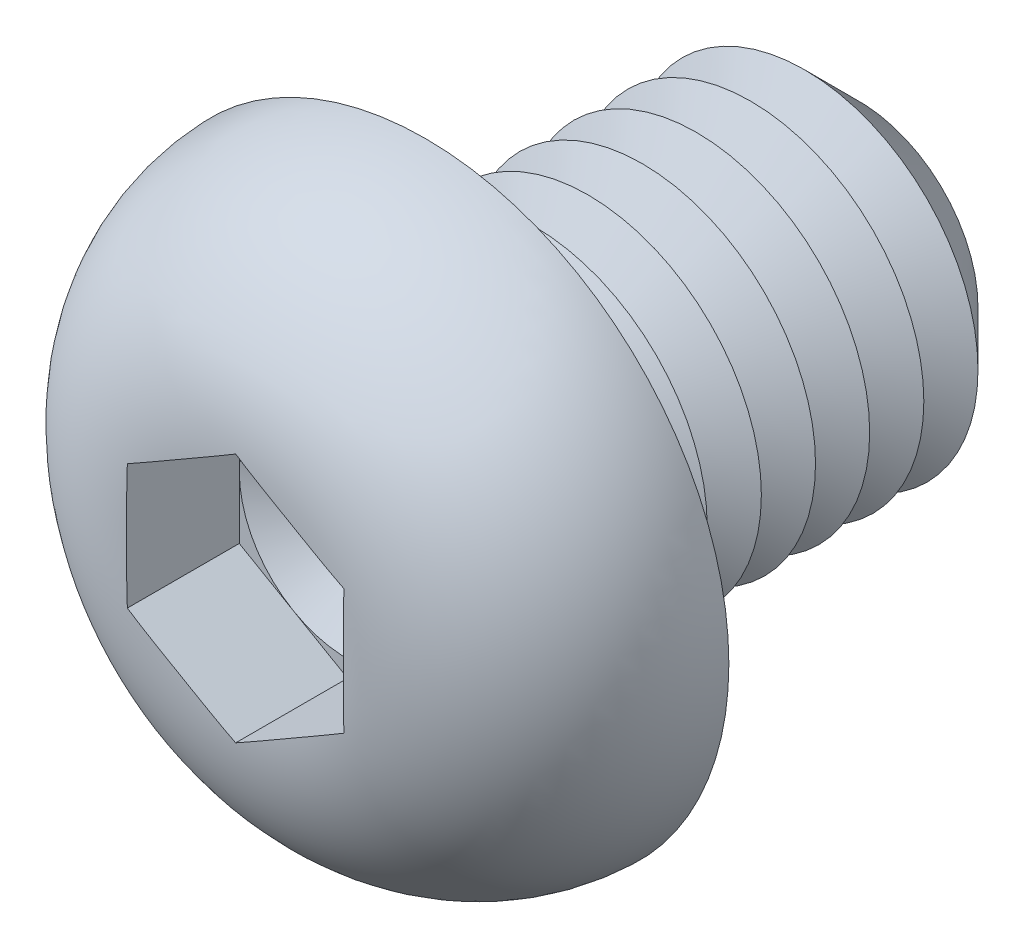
ISO-10303-21;
HEADER;
FILE_DESCRIPTION(('STEP AP214'),'2;1');
FILE_NAME('part.step','',(''),(''),'','','');
FILE_SCHEMA(('AUTOMOTIVE_DESIGN { 1 0 10303 214 1 1 1 1 }'));
ENDSEC;
DATA;
#1=APPLICATION_CONTEXT('core data for automotive mechanical design processes');
#2=APPLICATION_PROTOCOL_DEFINITION('international standard','automotive_design',2000,#1);
#3=PRODUCT_CONTEXT('',#1,'mechanical');
#4=PRODUCT('Part','Part','',(#3));
#5=PRODUCT_RELATED_PRODUCT_CATEGORY('part','',(#4));
#6=PRODUCT_DEFINITION_FORMATION('','',#4);
#7=PRODUCT_DEFINITION_CONTEXT('part definition',#1,'design');
#8=PRODUCT_DEFINITION('design','',#6,#7);
#9=PRODUCT_DEFINITION_SHAPE('','',#8);
#10=(LENGTH_UNIT() NAMED_UNIT(*) SI_UNIT(.MILLI.,.METRE.));
#11=(NAMED_UNIT(*) PLANE_ANGLE_UNIT() SI_UNIT($,.RADIAN.));
#12=(NAMED_UNIT(*) SI_UNIT($,.STERADIAN.) SOLID_ANGLE_UNIT());
#13=UNCERTAINTY_MEASURE_WITH_UNIT(LENGTH_MEASURE(1.E-05),#10,'distance_accuracy_value','');
#14=(GEOMETRIC_REPRESENTATION_CONTEXT(3) GLOBAL_UNCERTAINTY_ASSIGNED_CONTEXT((#13)) GLOBAL_UNIT_ASSIGNED_CONTEXT((#10,
#11,#12)) REPRESENTATION_CONTEXT('',''));
#15=CARTESIAN_POINT('',(0.,0.,0.));
#16=DIRECTION('',(0.,0.,1.));
#17=DIRECTION('',(1.,0.,0.));
#18=AXIS2_PLACEMENT_3D('',#15,#16,#17);
#19=CARTESIAN_POINT('',(0.,0.,1.8));
#20=DIRECTION('',(0.,0.,1.));
#21=DIRECTION('',(1.,0.,0.));
#22=AXIS2_PLACEMENT_3D('',#19,#20,#21);
#23=PLANE('',#22);
#24=CARTESIAN_POINT('',(0.,0.,1.8));
#25=DIRECTION('',(0.,0.,1.));
#26=DIRECTION('',(1.,0.,0.));
#27=AXIS2_PLACEMENT_3D('',#24,#25,#26);
#28=CIRCLE('',#27,2.5);
#29=CARTESIAN_POINT('',(2.5,0.,1.8));
#30=VERTEX_POINT('',#29);
#31=CARTESIAN_POINT('',(1.25,2.1650635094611,1.8));
#32=VERTEX_POINT('',#31);
#33=EDGE_CURVE('E153',#30,#32,#28,.T.);
#34=ORIENTED_EDGE('',*,*,#33,.F.);
#35=DIRECTION('',(0.,1.,0.));
#36=VECTOR('',#35,1.);
#37=CARTESIAN_POINT('',(2.5,-1.44337567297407,1.8));
#38=LINE('',#37,#36);
#39=CARTESIAN_POINT('',(2.5,1.44337567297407,1.8));
#40=VERTEX_POINT('',#39);
#41=EDGE_CURVE('E176',#30,#40,#38,.T.);
#42=ORIENTED_EDGE('',*,*,#41,.T.);
#43=DIRECTION('',(-0.866025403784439,0.5,0.));
#44=VECTOR('',#43,1.);
#45=CARTESIAN_POINT('',(2.5,1.44337567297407,1.8));
#46=LINE('',#45,#44);
#47=EDGE_CURVE('E172',#40,#32,#46,.T.);
#48=ORIENTED_EDGE('',*,*,#47,.T.);
#49=EDGE_LOOP('',(#34,#42,#48));
#50=FACE_BOUND('',#49,.T.);
#51=ADVANCED_FACE('F39',(#50),#23,.T.);
#52=CARTESIAN_POINT('',(0.,0.,1.8));
#53=DIRECTION('',(0.,0.,1.));
#54=DIRECTION('',(1.,0.,0.));
#55=AXIS2_PLACEMENT_3D('',#52,#53,#54);
#56=CIRCLE('',#55,2.5);
#57=CARTESIAN_POINT('',(-1.25,2.1650635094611,1.8));
#58=VERTEX_POINT('',#57);
#59=EDGE_CURVE('E11',#32,#58,#56,.T.);
#60=ORIENTED_EDGE('',*,*,#59,.F.);
#61=CARTESIAN_POINT('',(0.,2.88675134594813,1.8));
#62=VERTEX_POINT('',#61);
#63=EDGE_CURVE('E166',#32,#62,#46,.T.);
#64=ORIENTED_EDGE('',*,*,#63,.T.);
#65=DIRECTION('',(-0.866025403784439,-0.5,0.));
#66=VECTOR('',#65,1.);
#67=CARTESIAN_POINT('',(0.,2.88675134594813,1.8));
#68=LINE('',#67,#66);
#69=EDGE_CURVE('E167',#62,#58,#68,.T.);
#70=ORIENTED_EDGE('',*,*,#69,.T.);
#71=EDGE_LOOP('',(#60,#64,#70));
#72=FACE_BOUND('',#71,.T.);
#73=ADVANCED_FACE('F165',(#72),#23,.T.);
#74=CARTESIAN_POINT('',(-2.5,0.,1.8));
#75=VERTEX_POINT('',#74);
#76=EDGE_CURVE('E49',#58,#75,#56,.T.);
#77=ORIENTED_EDGE('',*,*,#76,.F.);
#78=CARTESIAN_POINT('',(-2.5,1.44337567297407,1.8));
#79=VERTEX_POINT('',#78);
#80=EDGE_CURVE('E179',#58,#79,#68,.T.);
#81=ORIENTED_EDGE('',*,*,#80,.T.);
#82=DIRECTION('',(0.,-1.,0.));
#83=VECTOR('',#82,1.);
#84=CARTESIAN_POINT('',(-2.5,1.44337567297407,1.8));
#85=LINE('',#84,#83);
#86=EDGE_CURVE('E190',#79,#75,#85,.T.);
#87=ORIENTED_EDGE('',*,*,#86,.T.);
#88=EDGE_LOOP('',(#77,#81,#87));
#89=FACE_BOUND('',#88,.T.);
#90=ADVANCED_FACE('F439',(#89),#23,.T.);
#91=CARTESIAN_POINT('',(-1.25,-2.1650635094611,1.8));
#92=VERTEX_POINT('',#91);
#93=EDGE_CURVE('E423',#75,#92,#56,.T.);
#94=ORIENTED_EDGE('',*,*,#93,.F.);
#95=CARTESIAN_POINT('',(-2.5,-1.44337567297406,1.8));
#96=VERTEX_POINT('',#95);
#97=EDGE_CURVE('E189',#75,#96,#85,.T.);
#98=ORIENTED_EDGE('',*,*,#97,.T.);
#99=DIRECTION('',(0.866025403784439,-0.5,0.));
#100=VECTOR('',#99,1.);
#101=CARTESIAN_POINT('',(-2.5,-1.44337567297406,1.8));
#102=LINE('',#101,#100);
#103=EDGE_CURVE('E195',#96,#92,#102,.T.);
#104=ORIENTED_EDGE('',*,*,#103,.T.);
#105=EDGE_LOOP('',(#94,#98,#104));
#106=FACE_BOUND('',#105,.T.);
#107=ADVANCED_FACE('F434',(#106),#23,.T.);
#108=CARTESIAN_POINT('',(1.25,-2.1650635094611,1.8));
#109=VERTEX_POINT('',#108);
#110=EDGE_CURVE('E56',#92,#109,#56,.T.);
#111=ORIENTED_EDGE('',*,*,#110,.F.);
#112=CARTESIAN_POINT('',(0.,-2.88675134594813,1.8));
#113=VERTEX_POINT('',#112);
#114=EDGE_CURVE('E194',#92,#113,#102,.T.);
#115=ORIENTED_EDGE('',*,*,#114,.T.);
#116=DIRECTION('',(0.866025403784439,0.5,0.));
#117=VECTOR('',#116,1.);
#118=CARTESIAN_POINT('',(0.,-2.88675134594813,1.8));
#119=LINE('',#118,#117);
#120=EDGE_CURVE('E200',#113,#109,#119,.T.);
#121=ORIENTED_EDGE('',*,*,#120,.T.);
#122=EDGE_LOOP('',(#111,#115,#121));
#123=FACE_BOUND('',#122,.T.);
#124=ADVANCED_FACE('F472',(#123),#23,.T.);
#125=CARTESIAN_POINT('',(0.,0.,-10.));
#126=DIRECTION('',(0.,0.,1.));
#127=DIRECTION('',(1.,0.,0.));
#128=AXIS2_PLACEMENT_3D('',#125,#126,#127);
#129=CYLINDRICAL_SURFACE('',#128,4.);
#130=CARTESIAN_POINT('',(0.,0.,-0.5));
#131=DIRECTION('',(0.,0.,1.));
#132=DIRECTION('',(1.,0.,0.));
#133=AXIS2_PLACEMENT_3D('',#130,#131,#132);
#134=CIRCLE('',#133,4.);
#135=CARTESIAN_POINT('',(4.,0.,-0.5));
#136=VERTEX_POINT('',#135);
#137=EDGE_CURVE('E411',#136,#136,#134,.F.);
#138=ORIENTED_EDGE('',*,*,#137,.T.);
#139=EDGE_LOOP('',(#138));
#140=FACE_BOUND('',#139,.T.);
#141=CARTESIAN_POINT('',(0.,0.,-1.25));
#142=DIRECTION('',(0.,0.,1.));
#143=DIRECTION('',(1.,0.,0.));
#144=AXIS2_PLACEMENT_3D('',#141,#142,#143);
#145=CIRCLE('',#144,4.00000000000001);
#146=CARTESIAN_POINT('',(4.00000000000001,0.,-1.25));
#147=VERTEX_POINT('',#146);
#148=EDGE_CURVE('E185',#147,#147,#145,.T.);
#149=ORIENTED_EDGE('',*,*,#148,.T.);
#150=EDGE_LOOP('',(#149));
#151=FACE_BOUND('',#150,.T.);
#152=ADVANCED_FACE('F467',(#140,#151),#129,.T.);
#153=CARTESIAN_POINT('',(0.,7.,0.));
#154=DIRECTION('',(0.,0.,1.));
#155=DIRECTION('',(1.,0.,0.));
#156=AXIS2_PLACEMENT_3D('',#153,#154,#155);
#157=PLANE('',#156);
#158=CARTESIAN_POINT('',(0.,0.,0.));
#159=DIRECTION('',(0.,0.,1.));
#160=DIRECTION('',(1.,0.,0.));
#161=AXIS2_PLACEMENT_3D('',#158,#159,#160);
#162=CIRCLE('',#161,4.5);
#163=CARTESIAN_POINT('',(4.5,0.,0.));
#164=VERTEX_POINT('',#163);
#165=EDGE_CURVE('E414',#164,#164,#162,.T.);
#166=ORIENTED_EDGE('',*,*,#165,.T.);
#167=EDGE_LOOP('',(#166));
#168=FACE_BOUND('',#167,.T.);
#169=CARTESIAN_POINT('',(0.,0.,0.));
#170=DIRECTION('',(0.,0.,1.));
#171=DIRECTION('',(1.,0.,0.));
#172=AXIS2_PLACEMENT_3D('',#169,#170,#171);
#173=CIRCLE('',#172,7.);
#174=CARTESIAN_POINT('',(7.,0.,0.));
#175=VERTEX_POINT('',#174);
#176=EDGE_CURVE('E211',#175,#175,#173,.T.);
#177=ORIENTED_EDGE('',*,*,#176,.F.);
#178=EDGE_LOOP('',(#177));
#179=FACE_BOUND('',#178,.T.);
#180=ADVANCED_FACE('F465',(#168,#179),#157,.F.);
#181=CARTESIAN_POINT('',(0.,0.,-0.1));
#182=DIRECTION('',(0.,0.,1.));
#183=DIRECTION('',(1.,0.,0.));
#184=AXIS2_PLACEMENT_3D('',#181,#182,#183);
#185=DEGENERATE_TOROIDAL_SURFACE('',#184,2.5011112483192,4.5,.T.);
#186=CARTESIAN_POINT('',(1.31456088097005,2.12778926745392,4.4));
#187=DIRECTION('',(-0.866025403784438,0.500000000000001,0.));
#188=VECTOR('',#187,1.);
#189=LINE('',#186,#188);
#190=CARTESIAN_POINT('',(1.31456088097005,2.12778926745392,4.4));
#191=VERTEX_POINT('',#190);
#192=CARTESIAN_POINT('',(1.18543911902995,2.20233775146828,4.4));
#193=VERTEX_POINT('',#192);
#194=EDGE_CURVE('E399',#191,#193,#189,.T.);
#195=ORIENTED_EDGE('',*,*,#194,.F.);
#196=CARTESIAN_POINT('',(-0.000200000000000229,2.88686681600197,4.38343536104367));
#197=CARTESIAN_POINT('',(0.103935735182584,2.82674402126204,4.38859262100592));
#198=CARTESIAN_POINT('',(0.208111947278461,2.76659785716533,4.39207570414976));
#199=CARTESIAN_POINT('',(0.416486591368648,2.64629270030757,4.39683754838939));
#200=CARTESIAN_POINT('',(0.520685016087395,2.58613371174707,4.39811670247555));
#201=CARTESIAN_POINT('',(0.729066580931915,2.46582455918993,4.3996156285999));
#202=CARTESIAN_POINT('',(0.833249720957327,2.40567439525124,4.39983556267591));
#203=CARTESIAN_POINT('',(1.04162190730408,2.2853706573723,4.4000276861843));
#204=CARTESIAN_POINT('',(1.14581095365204,2.2252170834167,4.39999986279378));
#205=CARTESIAN_POINT('',(1.35418904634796,2.10490993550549,4.39999986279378));
#206=CARTESIAN_POINT('',(1.45837809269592,2.04475636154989,4.4000276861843));
#207=CARTESIAN_POINT('',(1.66675027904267,1.92445262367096,4.39983556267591));
#208=CARTESIAN_POINT('',(1.77093341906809,1.86430245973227,4.3996156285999));
#209=CARTESIAN_POINT('',(1.97931498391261,1.74399330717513,4.39811670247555));
#210=CARTESIAN_POINT('',(2.08351340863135,1.68383431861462,4.39683754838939));
#211=CARTESIAN_POINT('',(2.29188805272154,1.56352916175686,4.39207570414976));
#212=CARTESIAN_POINT('',(2.39606426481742,1.50338299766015,4.38859262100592));
#213=CARTESIAN_POINT('',(2.5002,1.44326020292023,4.38343536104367));
#214=B_SPLINE_CURVE_WITH_KNOTS('',3,(#196,#197,#198,#199,#200,#201,#202,#203,#204,#205,#206,
#207,#208,#209,#210,#211,#212,#213),.UNSPECIFIED.,.F.,.F.,(4,2,2,2,2,2,2,2,4),(0.,
0.361022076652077,0.721979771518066,1.08288224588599,1.44380339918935,1.80472455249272,
2.16562702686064,2.52658472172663,2.88760679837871),.UNSPECIFIED.);
#215=CARTESIAN_POINT('',(2.5,1.44337567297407,4.38344529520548));
#216=VERTEX_POINT('',#215);
#217=EDGE_CURVE('E355',#191,#216,#214,.T.);
#218=ORIENTED_EDGE('',*,*,#217,.T.);
#219=CARTESIAN_POINT('',(2.5,0.,4.39999986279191));
#220=CARTESIAN_POINT('',(2.5,-0.104697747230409,4.39999811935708));
#221=CARTESIAN_POINT('',(2.5,-0.209395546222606,4.40001551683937));
#222=CARTESIAN_POINT('',(2.5,-0.418792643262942,4.39990807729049));
#223=CARTESIAN_POINT('',(2.5,-0.52349194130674,4.39978323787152));
#224=CARTESIAN_POINT('',(2.5,-0.732936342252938,4.39891238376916));
#225=CARTESIAN_POINT('',(2.5,-0.837681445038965,4.39816609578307));
#226=CARTESIAN_POINT('',(2.5,-1.04715282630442,4.39536239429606));
#227=CARTESIAN_POINT('',(2.5,-1.15187910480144,4.39330498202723));
#228=CARTESIAN_POINT('',(2.5,-1.46476484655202,4.38400647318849));
#229=CARTESIAN_POINT('',(2.5,-1.67286375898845,4.37365196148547));
#230=CARTESIAN_POINT('',(2.5,-2.08783281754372,4.33852954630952));
#231=CARTESIAN_POINT('',(2.5,-2.29470379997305,4.31377296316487));
#232=CARTESIAN_POINT('',(2.5,-2.64451002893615,4.25536510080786));
#233=CARTESIAN_POINT('',(2.5,-2.78823975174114,4.22651785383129));
#234=CARTESIAN_POINT('',(2.5,-3.073224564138,4.15827060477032));
#235=CARTESIAN_POINT('',(2.5,-3.21447933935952,4.11886927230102));
#236=CARTESIAN_POINT('',(2.5,-3.49353952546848,4.02870287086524));
#237=CARTESIAN_POINT('',(2.5,-3.6313402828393,3.97792330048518));
#238=CARTESIAN_POINT('',(2.5,-3.90204977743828,3.86463774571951));
#239=CARTESIAN_POINT('',(2.5,-4.0349587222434,3.8021322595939));
#240=CARTESIAN_POINT('',(2.5,-4.2956525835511,3.66474880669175));
#241=CARTESIAN_POINT('',(2.5,-4.42338586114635,3.58977252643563));
#242=CARTESIAN_POINT('',(2.5,-4.67118559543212,3.42803136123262));
#243=CARTESIAN_POINT('',(2.5,-4.79125159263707,3.3412657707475));
#244=CARTESIAN_POINT('',(2.5,-5.02233156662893,3.15645800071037));
#245=CARTESIAN_POINT('',(2.5,-5.13334771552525,3.05841854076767));
#246=CARTESIAN_POINT('',(2.5,-5.34506083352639,2.85177471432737));
#247=CARTESIAN_POINT('',(2.5,-5.44575933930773,2.74317192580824));
#248=CARTESIAN_POINT('',(2.5,-5.62335564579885,2.53102225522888));
#249=CARTESIAN_POINT('',(2.5,-5.70164721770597,2.42863868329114));
#250=CARTESIAN_POINT('',(2.5,-5.84882394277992,2.21725758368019));
#251=CARTESIAN_POINT('',(2.5,-5.91770588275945,2.10825781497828));
#252=CARTESIAN_POINT('',(2.5,-6.04532926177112,1.88460009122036));
#253=CARTESIAN_POINT('',(2.5,-6.1040794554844,1.76994713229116));
#254=CARTESIAN_POINT('',(2.5,-6.21098181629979,1.53574793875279));
#255=CARTESIAN_POINT('',(2.5,-6.25913021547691,1.41619998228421));
#256=CARTESIAN_POINT('',(2.5,-6.34173830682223,1.18065209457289));
#257=CARTESIAN_POINT('',(2.5,-6.37685491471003,1.06488207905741));
#258=CARTESIAN_POINT('',(2.5,-6.43703913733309,0.830714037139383));
#259=CARTESIAN_POINT('',(2.5,-6.46210319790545,0.712315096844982));
#260=CARTESIAN_POINT('',(2.5,-6.50194044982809,0.473848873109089));
#261=CARTESIAN_POINT('',(2.5,-6.51671856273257,0.353782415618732));
#262=CARTESIAN_POINT('',(2.5,-6.53588982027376,0.112808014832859));
#263=CARTESIAN_POINT('',(2.5,-6.54027911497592,-0.00810022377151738));
#264=CARTESIAN_POINT('',(2.5,-6.53779027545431,-0.365870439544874));
#265=CARTESIAN_POINT('',(2.5,-6.51607942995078,-0.602790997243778));
#266=CARTESIAN_POINT('',(2.5,-6.43310265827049,-1.06957107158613));
#267=CARTESIAN_POINT('',(2.5,-6.3718398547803,-1.29943114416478));
#268=CARTESIAN_POINT('',(2.5,-6.25195024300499,-1.63390601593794));
#269=CARTESIAN_POINT('',(2.5,-6.20730237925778,-1.74371189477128));
#270=CARTESIAN_POINT('',(2.5,-6.10902350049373,-1.95921136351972));
#271=CARTESIAN_POINT('',(2.5,-6.05539567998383,-2.06490639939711));
#272=CARTESIAN_POINT('',(2.5,-5.93955620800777,-2.27152527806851));
#273=CARTESIAN_POINT('',(2.5,-5.87734126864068,-2.37244727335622));
#274=CARTESIAN_POINT('',(2.5,-5.7448545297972,-2.56880727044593));
#275=CARTESIAN_POINT('',(2.5,-5.67458537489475,-2.6642470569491));
#276=CARTESIAN_POINT('',(2.5,-5.52523018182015,-2.85070592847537));
#277=CARTESIAN_POINT('',(2.5,-5.44601185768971,-2.94161901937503));
#278=CARTESIAN_POINT('',(2.5,-5.28044044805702,-3.11663859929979));
#279=CARTESIAN_POINT('',(2.5,-5.194089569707,-3.2007471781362));
#280=CARTESIAN_POINT('',(2.5,-5.01485870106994,-3.36178408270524));
#281=CARTESIAN_POINT('',(2.5,-4.92197538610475,-3.43870870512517));
#282=CARTESIAN_POINT('',(2.5,-4.73045535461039,-3.58495812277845));
#283=CARTESIAN_POINT('',(2.5,-4.6318202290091,-3.65428500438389));
#284=CARTESIAN_POINT('',(2.5,-4.4247626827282,-3.78818551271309));
#285=CARTESIAN_POINT('',(2.5,-4.31609824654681,-3.85238474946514));
#286=CARTESIAN_POINT('',(2.5,-4.0940582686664,-3.97208975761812));
#287=CARTESIAN_POINT('',(2.5,-3.98068153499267,-4.02759331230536));
#288=CARTESIAN_POINT('',(2.5,-3.75029026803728,-4.12981004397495));
#289=CARTESIAN_POINT('',(2.5,-3.63328275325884,-4.17653908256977));
#290=CARTESIAN_POINT('',(2.5,-3.39631992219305,-4.2614893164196));
#291=CARTESIAN_POINT('',(2.5,-3.27636651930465,-4.29971587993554));
#292=CARTESIAN_POINT('',(2.5,-3.00446622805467,-4.37644925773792));
#293=CARTESIAN_POINT('',(2.5,-2.85188931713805,-4.41272455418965));
#294=CARTESIAN_POINT('',(2.5,-2.54443794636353,-4.47385449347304));
#295=CARTESIAN_POINT('',(2.5,-2.3895624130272,-4.49870361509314));
#296=CARTESIAN_POINT('',(2.5,-2.07807451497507,-4.53870829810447));
#297=CARTESIAN_POINT('',(2.5,-1.92145805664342,-4.55383091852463));
#298=CARTESIAN_POINT('',(2.5,-1.60772330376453,-4.57647936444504));
#299=CARTESIAN_POINT('',(2.5,-1.45060502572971,-4.58400543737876));
#300=CARTESIAN_POINT('',(2.5,-1.13432460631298,-4.59416656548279));
#301=CARTESIAN_POINT('',(2.5,-0.975160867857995,-4.59674096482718));
#302=CARTESIAN_POINT('',(2.5,-0.656826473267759,-4.59957813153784));
#303=CARTESIAN_POINT('',(2.5,-0.497655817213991,-4.59984092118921));
#304=CARTESIAN_POINT('',(2.5,-0.179547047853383,-4.60005428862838));
#305=CARTESIAN_POINT('',(2.5,-0.02060893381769,-4.60000532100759));
#306=CARTESIAN_POINT('',(2.5,0.297265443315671,-4.59999304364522));
#307=CARTESIAN_POINT('',(2.5,0.456201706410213,-4.60002973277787));
#308=CARTESIAN_POINT('',(2.5,0.70967559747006,-4.59902611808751));
#309=CARTESIAN_POINT('',(2.5,0.804213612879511,-4.59841616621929));
#310=CARTESIAN_POINT('',(2.5,0.99327694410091,-4.59620676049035));
#311=CARTESIAN_POINT('',(2.5,1.08780225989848,-4.59460730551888));
#312=CARTESIAN_POINT('',(2.5,1.37137837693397,-4.58746770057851));
#313=CARTESIAN_POINT('',(2.5,1.56039301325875,-4.57958602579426));
#314=CARTESIAN_POINT('',(2.5,1.93609462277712,-4.55305686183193));
#315=CARTESIAN_POINT('',(2.5,2.12278756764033,-4.53450331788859));
#316=CARTESIAN_POINT('',(2.5,2.49421016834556,-4.48296248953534));
#317=CARTESIAN_POINT('',(2.5,2.67894050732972,-4.44998040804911));
#318=CARTESIAN_POINT('',(2.5,2.99962701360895,-4.37718406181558));
#319=CARTESIAN_POINT('',(2.5,3.13641465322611,-4.34103978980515));
#320=CARTESIAN_POINT('',(2.5,3.40682838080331,-4.25834226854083));
#321=CARTESIAN_POINT('',(2.5,3.54045461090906,-4.21178948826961));
#322=CARTESIAN_POINT('',(2.5,3.80387940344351,-4.1076796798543));
#323=CARTESIAN_POINT('',(2.5,3.93366385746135,-4.05008679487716));
#324=CARTESIAN_POINT('',(2.5,4.18776789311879,-3.92385886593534));
#325=CARTESIAN_POINT('',(2.5,4.31208736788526,-3.85522360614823));
#326=CARTESIAN_POINT('',(2.5,4.55475418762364,-3.70660227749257));
#327=CARTESIAN_POINT('',(2.5,4.67306276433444,-3.62655275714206));
#328=CARTESIAN_POINT('',(2.5,4.90171316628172,-3.45576294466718));
#329=CARTESIAN_POINT('',(2.5,5.01205476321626,-3.36502234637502));
#330=CARTESIAN_POINT('',(2.5,5.22347091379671,-3.17353376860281));
#331=CARTESIAN_POINT('',(2.5,5.32455555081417,-3.07279693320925));
#332=CARTESIAN_POINT('',(2.5,5.51647993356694,-2.86200023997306));
#333=CARTESIAN_POINT('',(2.5,5.6073208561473,-2.75194145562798));
#334=CARTESIAN_POINT('',(2.5,5.76832451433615,-2.53607083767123));
#335=CARTESIAN_POINT('',(2.5,5.83966300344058,-2.4311337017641));
#336=CARTESIAN_POINT('',(2.5,5.97282702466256,-2.2153291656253));
#337=CARTESIAN_POINT('',(2.5,6.03464926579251,-2.10445973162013));
#338=CARTESIAN_POINT('',(2.5,6.14815657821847,-1.87771731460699));
#339=CARTESIAN_POINT('',(2.5,6.19984675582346,-1.76184688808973));
#340=CARTESIAN_POINT('',(2.5,6.29267395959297,-1.52590109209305));
#341=CARTESIAN_POINT('',(2.5,6.33380720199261,-1.40582423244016));
#342=CARTESIAN_POINT('',(2.5,6.40328888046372,-1.16869740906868));
#343=CARTESIAN_POINT('',(2.5,6.43218419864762,-1.05180738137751));
#344=CARTESIAN_POINT('',(2.5,6.47988151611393,-0.815941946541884));
#345=CARTESIAN_POINT('',(2.5,6.49867991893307,-0.696965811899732));
#346=CARTESIAN_POINT('',(2.5,6.52599950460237,-0.457898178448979));
#347=CARTESIAN_POINT('',(2.5,6.53452634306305,-0.337807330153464));
#348=CARTESIAN_POINT('',(2.5,6.54126106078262,-0.0973214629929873));
#349=CARTESIAN_POINT('',(2.5,6.5394651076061,0.023073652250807));
#350=CARTESIAN_POINT('',(2.5,6.51879545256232,0.379398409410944));
#351=CARTESIAN_POINT('',(2.5,6.48510560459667,0.614630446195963));
#352=CARTESIAN_POINT('',(2.5,6.37872360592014,1.07608887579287));
#353=CARTESIAN_POINT('',(2.5,6.30603128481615,1.3023152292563));
#354=CARTESIAN_POINT('',(2.5,6.16957161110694,1.63028303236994));
#355=CARTESIAN_POINT('',(2.5,6.11941470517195,1.7378698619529));
#356=CARTESIAN_POINT('',(2.5,6.01034124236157,1.94849153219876));
#357=CARTESIAN_POINT('',(2.5,5.9514277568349,2.05152795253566));
#358=CARTESIAN_POINT('',(2.5,5.82528890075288,2.25240256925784));
#359=CARTESIAN_POINT('',(2.5,5.75806159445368,2.35023954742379));
#360=CARTESIAN_POINT('',(2.5,5.61585543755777,2.54005689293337));
#361=CARTESIAN_POINT('',(2.5,5.54087908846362,2.63203913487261));
#362=CARTESIAN_POINT('',(2.5,5.38212190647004,2.81146438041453));
#363=CARTESIAN_POINT('',(2.5,5.29819182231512,2.89877528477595));
#364=CARTESIAN_POINT('',(2.5,5.12353712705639,3.06625194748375));
#365=CARTESIAN_POINT('',(2.5,5.03281455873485,3.14641983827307));
#366=CARTESIAN_POINT('',(2.5,4.84518171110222,3.29930665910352));
#367=CARTESIAN_POINT('',(2.5,4.74826657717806,3.37201962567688));
#368=CARTESIAN_POINT('',(2.5,4.54907485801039,3.50961479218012));
#369=CARTESIAN_POINT('',(2.5,4.44679969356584,3.57449905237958));
#370=CARTESIAN_POINT('',(2.5,4.23202545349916,3.69953578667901));
#371=CARTESIAN_POINT('',(2.5,4.11927203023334,3.75925114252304));
#372=CARTESIAN_POINT('',(2.5,3.88947986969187,3.86977617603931));
#373=CARTESIAN_POINT('',(2.5,3.77244067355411,3.92058489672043));
#374=CARTESIAN_POINT('',(2.5,3.5351804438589,4.0133148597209));
#375=CARTESIAN_POINT('',(2.5,3.41496637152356,4.0552539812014));
#376=CARTESIAN_POINT('',(2.5,3.17195278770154,4.13067246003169));
#377=CARTESIAN_POINT('',(2.5,3.04915378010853,4.16415344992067));
#378=CARTESIAN_POINT('',(2.5,2.80683027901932,4.22194717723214));
#379=CARTESIAN_POINT('',(2.5,2.68738216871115,4.2465834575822));
#380=CARTESIAN_POINT('',(2.5,2.44729214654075,4.28920746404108));
#381=CARTESIAN_POINT('',(2.5,2.32664997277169,4.30719369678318));
#382=CARTESIAN_POINT('',(2.5,2.08450864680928,4.33736171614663));
#383=CARTESIAN_POINT('',(2.5,1.9630086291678,4.3495363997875));
#384=CARTESIAN_POINT('',(2.5,1.71961501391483,4.36908103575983));
#385=CARTESIAN_POINT('',(2.5,1.59772134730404,4.37645009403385));
#386=CARTESIAN_POINT('',(2.5,1.35283283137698,4.38761579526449));
#387=CARTESIAN_POINT('',(2.5,1.22983679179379,4.39138420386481));
#388=CARTESIAN_POINT('',(2.5,0.983808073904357,4.3965493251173));
#389=CARTESIAN_POINT('',(2.5,0.860775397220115,4.3979461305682));
#390=CARTESIAN_POINT('',(2.5,0.614783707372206,4.39958107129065));
#391=CARTESIAN_POINT('',(2.5,0.491824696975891,4.3998199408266));
#392=CARTESIAN_POINT('',(2.5,0.245910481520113,4.40003035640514));
#393=CARTESIAN_POINT('',(2.5,0.122955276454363,4.4000019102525));
#394=CARTESIAN_POINT('',(2.5,0.,4.39999986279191));
#395=B_SPLINE_CURVE_WITH_KNOTS('',3,(#219,#220,#221,#222,#223,#224,#225,#226,#227,#228,#229,
#230,#231,#232,#233,#234,#235,#236,#237,#238,#239,#240,#241,#242,#243,#244,#245,#246,#247,#248,
#249,#250,#251,#252,#253,#254,#255,#256,#257,#258,#259,#260,#261,#262,#263,#264,#265,#266,#267,
#268,#269,#270,#271,#272,#273,#274,#275,#276,#277,#278,#279,#280,#281,#282,#283,#284,#285,#286,
#287,#288,#289,#290,#291,#292,#293,#294,#295,#296,#297,#298,#299,#300,#301,#302,#303,#304,#305,
#306,#307,#308,#309,#310,#311,#312,#313,#314,#315,#316,#317,#318,#319,#320,#321,#322,#323,#324,
#325,#326,#327,#328,#329,#330,#331,#332,#333,#334,#335,#336,#337,#338,#339,#340,#341,#342,#343,
#344,#345,#346,#347,#348,#349,#350,#351,#352,#353,#354,#355,#356,#357,#358,#359,#360,#361,#362,
#363,#364,#365,#366,#367,#368,#369,#370,#371,#372,#373,#374,#375,#376,#377,#378,#379,#380,#381,
#382,#383,#384,#385,#386,#387,#388,#389,#390,#391,#392,#393,#394),.UNSPECIFIED.,.T.,.F.,(4,2,2,
2,2,2,2,2,2,2,2,2,2,2,2,2,2,2,2,2,2,2,2,2,2,2,2,2,2,2,2,2,2,2,2,2,2,2,2,2,2,2,2,2,2,2,2,2,2,2,2,
2,2,2,2,2,2,2,2,2,2,2,2,2,2,2,2,2,2,2,2,2,2,2,2,2,2,2,2,2,2,2,2,2,2,2,2,4),(0.,
0.314093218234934,0.62819170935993,0.942428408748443,1.25666481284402,1.88144147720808,
2.50572771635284,2.94516878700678,3.38466527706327,3.82472511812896,4.26476626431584,
4.70845695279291,5.15217420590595,5.59578464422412,6.03932891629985,6.42549664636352,
6.81179591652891,7.19775970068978,7.58386043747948,7.94635637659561,8.30898036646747,
8.67143073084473,9.03401539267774,9.74414367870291,10.4542159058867,10.8094792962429,
11.1646165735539,11.5198902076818,11.8750475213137,12.2363927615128,12.597626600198,
12.9590456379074,13.3203651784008,13.698597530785,14.0769261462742,14.4545641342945,
14.8319630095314,15.3019396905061,15.7721432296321,16.2439309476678,16.715703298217,
17.1932187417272,17.6707295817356,18.1475442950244,18.6243527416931,18.9079682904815,
19.1915841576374,19.7589248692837,20.3213460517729,20.8835645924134,21.3076400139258,
21.731696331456,22.1571540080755,22.5826200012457,23.0105507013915,23.4384936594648,
23.8659647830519,24.2933867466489,24.6735755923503,25.0538956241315,25.4340234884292,
25.8142874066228,26.1750761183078,26.5359932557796,26.8967115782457,27.2575638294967,
27.9668653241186,28.6761699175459,29.0319382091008,29.3875820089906,29.7433087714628,
30.0989210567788,30.4618400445,30.8246503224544,31.1877485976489,31.5507511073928,
31.9331198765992,32.3155297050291,32.6971611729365,33.0787189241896,33.4443988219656,
33.8101607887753,34.1763686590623,34.54264464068,34.9117697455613,35.2808804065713,
35.6497569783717,36.0186227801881),.UNSPECIFIED.);
#396=CARTESIAN_POINT('',(2.5,0.0745484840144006,4.4));
#397=VERTEX_POINT('',#396);
#398=EDGE_CURVE('E345',#216,#397,#395,.T.);
#399=ORIENTED_EDGE('',*,*,#398,.T.);
#400=CARTESIAN_POINT('',(2.5,-0.0745484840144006,4.4));
#401=DIRECTION('',(0.,1.,0.));
#402=VECTOR('',#401,1.);
#403=LINE('',#400,#402);
#404=CARTESIAN_POINT('',(2.5,-0.0745484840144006,4.4));
#405=VERTEX_POINT('',#404);
#406=EDGE_CURVE('E174',#405,#397,#403,.T.);
#407=ORIENTED_EDGE('',*,*,#406,.F.);
#408=CARTESIAN_POINT('',(2.5,-1.44337567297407,4.38344529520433));
#409=VERTEX_POINT('',#408);
#410=EDGE_CURVE('E356',#405,#409,#395,.T.);
#411=ORIENTED_EDGE('',*,*,#410,.T.);
#412=CARTESIAN_POINT('',(2.5002,-1.44326020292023,4.38343536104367));
#413=CARTESIAN_POINT('',(2.39606426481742,-1.50338299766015,4.38859262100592));
#414=CARTESIAN_POINT('',(2.29188805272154,-1.56352916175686,4.39207570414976));
#415=CARTESIAN_POINT('',(2.08351340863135,-1.68383431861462,4.39683754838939));
#416=CARTESIAN_POINT('',(1.9793149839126,-1.74399330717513,4.39811670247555));
#417=CARTESIAN_POINT('',(1.77093341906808,-1.86430245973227,4.3996156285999));
#418=CARTESIAN_POINT('',(1.66675027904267,-1.92445262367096,4.39983556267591));
#419=CARTESIAN_POINT('',(1.45837809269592,-2.04475636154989,4.4000276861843));
#420=CARTESIAN_POINT('',(1.35418904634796,-2.10490993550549,4.39999986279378));
#421=CARTESIAN_POINT('',(1.14581095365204,-2.2252170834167,4.39999986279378));
#422=CARTESIAN_POINT('',(1.04162190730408,-2.2853706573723,4.4000276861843));
#423=CARTESIAN_POINT('',(0.833249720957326,-2.40567439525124,4.39983556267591));
#424=CARTESIAN_POINT('',(0.729066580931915,-2.46582455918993,4.3996156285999));
#425=CARTESIAN_POINT('',(0.520685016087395,-2.58613371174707,4.39811670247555));
#426=CARTESIAN_POINT('',(0.416486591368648,-2.64629270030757,4.39683754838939));
#427=CARTESIAN_POINT('',(0.208111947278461,-2.76659785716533,4.39207570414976));
#428=CARTESIAN_POINT('',(0.103935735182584,-2.82674402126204,4.38859262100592));
#429=CARTESIAN_POINT('',(-0.000200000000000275,-2.88686681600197,4.38343536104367));
#430=B_SPLINE_CURVE_WITH_KNOTS('',3,(#412,#413,#414,#415,#416,#417,#418,#419,#420,#421,#422,
#423,#424,#425,#426,#427,#428,#429),.UNSPECIFIED.,.F.,.F.,(4,2,2,2,2,2,2,2,4),(0.,
0.361022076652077,0.721979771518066,1.08288224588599,1.44380339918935,1.80472455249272,
2.16562702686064,2.52658472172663,2.88760679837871),.UNSPECIFIED.);
#431=CARTESIAN_POINT('',(1.31456088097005,-2.12778926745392,4.4));
#432=VERTEX_POINT('',#431);
#433=EDGE_CURVE('E332',#409,#432,#430,.T.);
#434=ORIENTED_EDGE('',*,*,#433,.T.);
#435=CARTESIAN_POINT('',(1.18543911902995,-2.20233775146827,4.4));
#436=DIRECTION('',(0.866025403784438,0.500000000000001,0.));
#437=VECTOR('',#436,1.);
#438=LINE('',#435,#437);
#439=CARTESIAN_POINT('',(1.18543911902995,-2.20233775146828,4.4));
#440=VERTEX_POINT('',#439);
#441=EDGE_CURVE('E341',#440,#432,#438,.T.);
#442=ORIENTED_EDGE('',*,*,#441,.F.);
#443=CARTESIAN_POINT('',(0.,-2.88675134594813,4.38344529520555));
#444=VERTEX_POINT('',#443);
#445=EDGE_CURVE('E295',#440,#444,#430,.T.);
#446=ORIENTED_EDGE('',*,*,#445,.T.);
#447=CARTESIAN_POINT('',(0.00019999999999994,-2.88686681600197,4.38343536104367));
#448=CARTESIAN_POINT('',(-0.103935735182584,-2.82674402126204,4.38859262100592));
#449=CARTESIAN_POINT('',(-0.208111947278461,-2.76659785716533,4.39207570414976));
#450=CARTESIAN_POINT('',(-0.416486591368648,-2.64629270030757,4.39683754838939));
#451=CARTESIAN_POINT('',(-0.520685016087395,-2.58613371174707,4.39811670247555));
#452=CARTESIAN_POINT('',(-0.729066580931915,-2.46582455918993,4.3996156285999));
#453=CARTESIAN_POINT('',(-0.833249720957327,-2.40567439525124,4.39983556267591));
#454=CARTESIAN_POINT('',(-1.04162190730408,-2.2853706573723,4.4000276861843));
#455=CARTESIAN_POINT('',(-1.14581095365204,-2.2252170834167,4.39999986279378));
#456=CARTESIAN_POINT('',(-1.35418904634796,-2.10490993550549,4.39999986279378));
#457=CARTESIAN_POINT('',(-1.45837809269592,-2.04475636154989,4.4000276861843));
#458=CARTESIAN_POINT('',(-1.66675027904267,-1.92445262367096,4.39983556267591));
#459=CARTESIAN_POINT('',(-1.77093341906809,-1.86430245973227,4.3996156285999));
#460=CARTESIAN_POINT('',(-1.97931498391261,-1.74399330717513,4.39811670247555));
#461=CARTESIAN_POINT('',(-2.08351340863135,-1.68383431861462,4.39683754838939));
#462=CARTESIAN_POINT('',(-2.29188805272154,-1.56352916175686,4.39207570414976));
#463=CARTESIAN_POINT('',(-2.39606426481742,-1.50338299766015,4.38859262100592));
#464=CARTESIAN_POINT('',(-2.5002,-1.44326020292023,4.38343536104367));
#465=B_SPLINE_CURVE_WITH_KNOTS('',3,(#447,#448,#449,#450,#451,#452,#453,#454,#455,#456,#457,
#458,#459,#460,#461,#462,#463,#464),.UNSPECIFIED.,.F.,.F.,(4,2,2,2,2,2,2,2,4),(0.,
0.361022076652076,0.721979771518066,1.08288224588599,1.44380339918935,1.80472455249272,
2.16562702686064,2.52658472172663,2.88760679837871),.UNSPECIFIED.);
#466=CARTESIAN_POINT('',(-1.18543911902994,-2.20233775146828,4.4));
#467=VERTEX_POINT('',#466);
#468=EDGE_CURVE('E285',#444,#467,#465,.T.);
#469=ORIENTED_EDGE('',*,*,#468,.T.);
#470=CARTESIAN_POINT('',(-1.31456088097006,-2.12778926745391,4.4));
#471=DIRECTION('',(0.86602540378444,-0.499999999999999,0.));
#472=VECTOR('',#471,1.);
#473=LINE('',#470,#472);
#474=CARTESIAN_POINT('',(-1.31456088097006,-2.12778926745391,4.4));
#475=VERTEX_POINT('',#474);
#476=EDGE_CURVE('E831',#475,#467,#473,.T.);
#477=ORIENTED_EDGE('',*,*,#476,.F.);
#478=CARTESIAN_POINT('',(-2.5,-1.44337567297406,4.38344529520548));
#479=VERTEX_POINT('',#478);
#480=EDGE_CURVE('E296',#475,#479,#465,.T.);
#481=ORIENTED_EDGE('',*,*,#480,.T.);
#482=CARTESIAN_POINT('',(-2.5,0.,4.39999986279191));
#483=CARTESIAN_POINT('',(-2.5,0.104697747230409,4.39999811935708));
#484=CARTESIAN_POINT('',(-2.5,0.209395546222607,4.40001551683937));
#485=CARTESIAN_POINT('',(-2.5,0.418792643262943,4.39990807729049));
#486=CARTESIAN_POINT('',(-2.5,0.523491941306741,4.39978323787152));
#487=CARTESIAN_POINT('',(-2.5,0.732936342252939,4.39891238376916));
#488=CARTESIAN_POINT('',(-2.5,0.837681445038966,4.39816609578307));
#489=CARTESIAN_POINT('',(-2.5,1.04715282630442,4.39536239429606));
#490=CARTESIAN_POINT('',(-2.5,1.15187910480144,4.39330498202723));
#491=CARTESIAN_POINT('',(-2.5,1.46476484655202,4.38400647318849));
#492=CARTESIAN_POINT('',(-2.5,1.67286375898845,4.37365196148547));
#493=CARTESIAN_POINT('',(-2.5,2.08783281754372,4.33852954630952));
#494=CARTESIAN_POINT('',(-2.5,2.29470379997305,4.31377296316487));
#495=CARTESIAN_POINT('',(-2.5,2.64451002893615,4.25536510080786));
#496=CARTESIAN_POINT('',(-2.5,2.78823975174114,4.22651785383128));
#497=CARTESIAN_POINT('',(-2.5,3.073224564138,4.15827060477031));
#498=CARTESIAN_POINT('',(-2.5,3.21447933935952,4.11886927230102));
#499=CARTESIAN_POINT('',(-2.5,3.49353952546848,4.02870287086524));
#500=CARTESIAN_POINT('',(-2.5,3.6313402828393,3.97792330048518));
#501=CARTESIAN_POINT('',(-2.5,3.90204977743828,3.8646377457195));
#502=CARTESIAN_POINT('',(-2.5,4.0349587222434,3.8021322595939));
#503=CARTESIAN_POINT('',(-2.5,4.2956525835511,3.66474880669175));
#504=CARTESIAN_POINT('',(-2.5,4.42338586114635,3.58977252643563));
#505=CARTESIAN_POINT('',(-2.5,4.67118559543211,3.42803136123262));
#506=CARTESIAN_POINT('',(-2.5,4.79125159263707,3.3412657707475));
#507=CARTESIAN_POINT('',(-2.5,5.02233156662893,3.15645800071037));
#508=CARTESIAN_POINT('',(-2.5,5.13334771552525,3.05841854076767));
#509=CARTESIAN_POINT('',(-2.5,5.34506083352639,2.85177471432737));
#510=CARTESIAN_POINT('',(-2.5,5.44575933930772,2.74317192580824));
#511=CARTESIAN_POINT('',(-2.5,5.62335564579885,2.53102225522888));
#512=CARTESIAN_POINT('',(-2.5,5.70164721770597,2.42863868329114));
#513=CARTESIAN_POINT('',(-2.5,5.84882394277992,2.21725758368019));
#514=CARTESIAN_POINT('',(-2.5,5.91770588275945,2.10825781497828));
#515=CARTESIAN_POINT('',(-2.5,6.04532926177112,1.88460009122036));
#516=CARTESIAN_POINT('',(-2.5,6.1040794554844,1.76994713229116));
#517=CARTESIAN_POINT('',(-2.5,6.21098181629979,1.53574793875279));
#518=CARTESIAN_POINT('',(-2.5,6.25913021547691,1.41619998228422));
#519=CARTESIAN_POINT('',(-2.5,6.34173830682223,1.18065209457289));
#520=CARTESIAN_POINT('',(-2.5,6.37685491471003,1.06488207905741));
#521=CARTESIAN_POINT('',(-2.5,6.43703913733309,0.830714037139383));
#522=CARTESIAN_POINT('',(-2.5,6.46210319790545,0.712315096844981));
#523=CARTESIAN_POINT('',(-2.5,6.50194044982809,0.473848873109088));
#524=CARTESIAN_POINT('',(-2.5,6.51671856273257,0.35378241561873));
#525=CARTESIAN_POINT('',(-2.5,6.53588982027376,0.112808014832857));
#526=CARTESIAN_POINT('',(-2.5,6.54027911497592,-0.00810022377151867));
#527=CARTESIAN_POINT('',(-2.5,6.53779027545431,-0.365870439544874));
#528=CARTESIAN_POINT('',(-2.5,6.51607942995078,-0.602790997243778));
#529=CARTESIAN_POINT('',(-2.5,6.43310265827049,-1.06957107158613));
#530=CARTESIAN_POINT('',(-2.5,6.3718398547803,-1.29943114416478));
#531=CARTESIAN_POINT('',(-2.5,6.25195024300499,-1.63390601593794));
#532=CARTESIAN_POINT('',(-2.5,6.20730237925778,-1.74371189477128));
#533=CARTESIAN_POINT('',(-2.5,6.10902350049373,-1.95921136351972));
#534=CARTESIAN_POINT('',(-2.5,6.05539567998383,-2.06490639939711));
#535=CARTESIAN_POINT('',(-2.5,5.93955620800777,-2.27152527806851));
#536=CARTESIAN_POINT('',(-2.5,5.87734126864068,-2.37244727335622));
#537=CARTESIAN_POINT('',(-2.5,5.7448545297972,-2.56880727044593));
#538=CARTESIAN_POINT('',(-2.5,5.67458537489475,-2.6642470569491));
#539=CARTESIAN_POINT('',(-2.5,5.52523018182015,-2.85070592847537));
#540=CARTESIAN_POINT('',(-2.5,5.44601185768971,-2.94161901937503));
#541=CARTESIAN_POINT('',(-2.5,5.28044044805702,-3.11663859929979));
#542=CARTESIAN_POINT('',(-2.5,5.194089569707,-3.2007471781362));
#543=CARTESIAN_POINT('',(-2.5,5.01485870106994,-3.36178408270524));
#544=CARTESIAN_POINT('',(-2.5,4.92197538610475,-3.43870870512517));
#545=CARTESIAN_POINT('',(-2.5,4.73045535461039,-3.58495812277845));
#546=CARTESIAN_POINT('',(-2.5,4.6318202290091,-3.65428500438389));
#547=CARTESIAN_POINT('',(-2.5,4.4247626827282,-3.78818551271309));
#548=CARTESIAN_POINT('',(-2.5,4.31609824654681,-3.85238474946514));
#549=CARTESIAN_POINT('',(-2.5,4.0940582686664,-3.97208975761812));
#550=CARTESIAN_POINT('',(-2.5,3.98068153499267,-4.02759331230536));
#551=CARTESIAN_POINT('',(-2.5,3.75029026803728,-4.12981004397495));
#552=CARTESIAN_POINT('',(-2.5,3.63328275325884,-4.17653908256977));
#553=CARTESIAN_POINT('',(-2.5,3.39631992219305,-4.2614893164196));
#554=CARTESIAN_POINT('',(-2.5,3.27636651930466,-4.29971587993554));
#555=CARTESIAN_POINT('',(-2.5,3.00446622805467,-4.37644925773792));
#556=CARTESIAN_POINT('',(-2.5,2.85188931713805,-4.41272455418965));
#557=CARTESIAN_POINT('',(-2.5,2.54443794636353,-4.47385449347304));
#558=CARTESIAN_POINT('',(-2.5,2.3895624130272,-4.49870361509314));
#559=CARTESIAN_POINT('',(-2.5,2.07807451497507,-4.53870829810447));
#560=CARTESIAN_POINT('',(-2.5,1.92145805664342,-4.55383091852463));
#561=CARTESIAN_POINT('',(-2.5,1.60772330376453,-4.57647936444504));
#562=CARTESIAN_POINT('',(-2.5,1.45060502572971,-4.58400543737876));
#563=CARTESIAN_POINT('',(-2.5,1.13432460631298,-4.59416656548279));
#564=CARTESIAN_POINT('',(-2.5,0.975160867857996,-4.59674096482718));
#565=CARTESIAN_POINT('',(-2.5,0.65682647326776,-4.59957813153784));
#566=CARTESIAN_POINT('',(-2.5,0.497655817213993,-4.59984092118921));
#567=CARTESIAN_POINT('',(-2.5,0.179547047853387,-4.60005428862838));
#568=CARTESIAN_POINT('',(-2.5,0.0206089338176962,-4.60000532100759));
#569=CARTESIAN_POINT('',(-2.5,-0.297265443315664,-4.59999304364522));
#570=CARTESIAN_POINT('',(-2.5,-0.456201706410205,-4.60002973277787));
#571=CARTESIAN_POINT('',(-2.5,-0.709675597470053,-4.59902611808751));
#572=CARTESIAN_POINT('',(-2.5,-0.804213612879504,-4.59841616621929));
#573=CARTESIAN_POINT('',(-2.5,-0.993276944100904,-4.59620676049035));
#574=CARTESIAN_POINT('',(-2.5,-1.08780225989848,-4.59460730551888));
#575=CARTESIAN_POINT('',(-2.5,-1.37137837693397,-4.58746770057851));
#576=CARTESIAN_POINT('',(-2.5,-1.56039301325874,-4.57958602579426));
#577=CARTESIAN_POINT('',(-2.5,-1.93609462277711,-4.55305686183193));
#578=CARTESIAN_POINT('',(-2.5,-2.12278756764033,-4.53450331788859));
#579=CARTESIAN_POINT('',(-2.5,-2.49421016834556,-4.48296248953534));
#580=CARTESIAN_POINT('',(-2.5,-2.67894050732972,-4.44998040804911));
#581=CARTESIAN_POINT('',(-2.5,-2.99962701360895,-4.37718406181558));
#582=CARTESIAN_POINT('',(-2.5,-3.13641465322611,-4.34103978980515));
#583=CARTESIAN_POINT('',(-2.5,-3.40682838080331,-4.25834226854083));
#584=CARTESIAN_POINT('',(-2.5,-3.54045461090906,-4.21178948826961));
#585=CARTESIAN_POINT('',(-2.5,-3.8038794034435,-4.1076796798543));
#586=CARTESIAN_POINT('',(-2.5,-3.93366385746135,-4.05008679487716));
#587=CARTESIAN_POINT('',(-2.5,-4.18776789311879,-3.92385886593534));
#588=CARTESIAN_POINT('',(-2.5,-4.31208736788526,-3.85522360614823));
#589=CARTESIAN_POINT('',(-2.5,-4.55475418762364,-3.70660227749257));
#590=CARTESIAN_POINT('',(-2.5,-4.67306276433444,-3.62655275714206));
#591=CARTESIAN_POINT('',(-2.5,-4.90171316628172,-3.45576294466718));
#592=CARTESIAN_POINT('',(-2.5,-5.01205476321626,-3.36502234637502));
#593=CARTESIAN_POINT('',(-2.5,-5.2234709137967,-3.17353376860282));
#594=CARTESIAN_POINT('',(-2.5,-5.32455555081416,-3.07279693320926));
#595=CARTESIAN_POINT('',(-2.5,-5.51647993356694,-2.86200023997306));
#596=CARTESIAN_POINT('',(-2.5,-5.6073208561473,-2.75194145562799));
#597=CARTESIAN_POINT('',(-2.5,-5.76832451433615,-2.53607083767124));
#598=CARTESIAN_POINT('',(-2.5,-5.83966300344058,-2.4311337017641));
#599=CARTESIAN_POINT('',(-2.5,-5.97282702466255,-2.2153291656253));
#600=CARTESIAN_POINT('',(-2.5,-6.03464926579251,-2.10445973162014));
#601=CARTESIAN_POINT('',(-2.5,-6.14815657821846,-1.877717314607));
#602=CARTESIAN_POINT('',(-2.5,-6.19984675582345,-1.76184688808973));
#603=CARTESIAN_POINT('',(-2.5,-6.29267395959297,-1.52590109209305));
#604=CARTESIAN_POINT('',(-2.5,-6.33380720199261,-1.40582423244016));
#605=CARTESIAN_POINT('',(-2.5,-6.40328888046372,-1.16869740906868));
#606=CARTESIAN_POINT('',(-2.5,-6.43218419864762,-1.05180738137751));
#607=CARTESIAN_POINT('',(-2.5,-6.47988151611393,-0.815941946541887));
#608=CARTESIAN_POINT('',(-2.5,-6.49867991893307,-0.696965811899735));
#609=CARTESIAN_POINT('',(-2.5,-6.52599950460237,-0.457898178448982));
#610=CARTESIAN_POINT('',(-2.5,-6.53452634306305,-0.337807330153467));
#611=CARTESIAN_POINT('',(-2.5,-6.54126106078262,-0.09732146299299));
#612=CARTESIAN_POINT('',(-2.5,-6.5394651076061,0.0230736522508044));
#613=CARTESIAN_POINT('',(-2.5,-6.51879545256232,0.379398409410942));
#614=CARTESIAN_POINT('',(-2.5,-6.48510560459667,0.614630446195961));
#615=CARTESIAN_POINT('',(-2.5,-6.37872360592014,1.07608887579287));
#616=CARTESIAN_POINT('',(-2.5,-6.30603128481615,1.3023152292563));
#617=CARTESIAN_POINT('',(-2.5,-6.16957161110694,1.63028303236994));
#618=CARTESIAN_POINT('',(-2.5,-6.11941470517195,1.7378698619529));
#619=CARTESIAN_POINT('',(-2.5,-6.01034124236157,1.94849153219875));
#620=CARTESIAN_POINT('',(-2.5,-5.9514277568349,2.05152795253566));
#621=CARTESIAN_POINT('',(-2.5,-5.82528890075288,2.25240256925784));
#622=CARTESIAN_POINT('',(-2.5,-5.75806159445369,2.35023954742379));
#623=CARTESIAN_POINT('',(-2.5,-5.61585543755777,2.54005689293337));
#624=CARTESIAN_POINT('',(-2.5,-5.54087908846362,2.63203913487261));
#625=CARTESIAN_POINT('',(-2.5,-5.38212190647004,2.81146438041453));
#626=CARTESIAN_POINT('',(-2.5,-5.29819182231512,2.89877528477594));
#627=CARTESIAN_POINT('',(-2.5,-5.1235371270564,3.06625194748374));
#628=CARTESIAN_POINT('',(-2.5,-5.03281455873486,3.14641983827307));
#629=CARTESIAN_POINT('',(-2.5,-4.84518171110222,3.29930665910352));
#630=CARTESIAN_POINT('',(-2.5,-4.74826657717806,3.37201962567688));
#631=CARTESIAN_POINT('',(-2.5,-4.54907485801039,3.50961479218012));
#632=CARTESIAN_POINT('',(-2.5,-4.44679969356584,3.57449905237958));
#633=CARTESIAN_POINT('',(-2.5,-4.23202545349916,3.69953578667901));
#634=CARTESIAN_POINT('',(-2.5,-4.11927203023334,3.75925114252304));
#635=CARTESIAN_POINT('',(-2.5,-3.88947986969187,3.86977617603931));
#636=CARTESIAN_POINT('',(-2.5,-3.77244067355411,3.92058489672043));
#637=CARTESIAN_POINT('',(-2.5,-3.5351804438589,4.0133148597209));
#638=CARTESIAN_POINT('',(-2.5,-3.41496637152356,4.0552539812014));
#639=CARTESIAN_POINT('',(-2.5,-3.17195278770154,4.13067246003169));
#640=CARTESIAN_POINT('',(-2.5,-3.04915378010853,4.16415344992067));
#641=CARTESIAN_POINT('',(-2.5,-2.80683027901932,4.22194717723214));
#642=CARTESIAN_POINT('',(-2.5,-2.68738216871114,4.2465834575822));
#643=CARTESIAN_POINT('',(-2.5,-2.44729214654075,4.28920746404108));
#644=CARTESIAN_POINT('',(-2.5,-2.32664997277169,4.30719369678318));
#645=CARTESIAN_POINT('',(-2.5,-2.08450864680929,4.33736171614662));
#646=CARTESIAN_POINT('',(-2.5,-1.96300862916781,4.34953639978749));
#647=CARTESIAN_POINT('',(-2.5,-1.71961501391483,4.36908103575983));
#648=CARTESIAN_POINT('',(-2.5,-1.59772134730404,4.37645009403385));
#649=CARTESIAN_POINT('',(-2.5,-1.35283283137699,4.38761579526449));
#650=CARTESIAN_POINT('',(-2.5,-1.2298367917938,4.39138420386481));
#651=CARTESIAN_POINT('',(-2.5,-0.983808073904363,4.3965493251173));
#652=CARTESIAN_POINT('',(-2.5,-0.860775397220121,4.3979461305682));
#653=CARTESIAN_POINT('',(-2.5,-0.61478370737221,4.39958107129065));
#654=CARTESIAN_POINT('',(-2.5,-0.491824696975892,4.3998199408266));
#655=CARTESIAN_POINT('',(-2.5,-0.245910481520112,4.40003035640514));
#656=CARTESIAN_POINT('',(-2.5,-0.122955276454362,4.4000019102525));
#657=CARTESIAN_POINT('',(-2.5,0.,4.39999986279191));
#658=B_SPLINE_CURVE_WITH_KNOTS('',3,(#482,#483,#484,#485,#486,#487,#488,#489,#490,#491,#492,
#493,#494,#495,#496,#497,#498,#499,#500,#501,#502,#503,#504,#505,#506,#507,#508,#509,#510,#511,
#512,#513,#514,#515,#516,#517,#518,#519,#520,#521,#522,#523,#524,#525,#526,#527,#528,#529,#530,
#531,#532,#533,#534,#535,#536,#537,#538,#539,#540,#541,#542,#543,#544,#545,#546,#547,#548,#549,
#550,#551,#552,#553,#554,#555,#556,#557,#558,#559,#560,#561,#562,#563,#564,#565,#566,#567,#568,
#569,#570,#571,#572,#573,#574,#575,#576,#577,#578,#579,#580,#581,#582,#583,#584,#585,#586,#587,
#588,#589,#590,#591,#592,#593,#594,#595,#596,#597,#598,#599,#600,#601,#602,#603,#604,#605,#606,
#607,#608,#609,#610,#611,#612,#613,#614,#615,#616,#617,#618,#619,#620,#621,#622,#623,#624,#625,
#626,#627,#628,#629,#630,#631,#632,#633,#634,#635,#636,#637,#638,#639,#640,#641,#642,#643,#644,
#645,#646,#647,#648,#649,#650,#651,#652,#653,#654,#655,#656,#657),.UNSPECIFIED.,.T.,.F.,(4,2,2,
2,2,2,2,2,2,2,2,2,2,2,2,2,2,2,2,2,2,2,2,2,2,2,2,2,2,2,2,2,2,2,2,2,2,2,2,2,2,2,2,2,2,2,2,2,2,2,2,
2,2,2,2,2,2,2,2,2,2,2,2,2,2,2,2,2,2,2,2,2,2,2,2,2,2,2,2,2,2,2,2,2,2,2,2,4),(0.,
0.314093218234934,0.62819170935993,0.942428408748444,1.25666481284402,1.88144147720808,
2.50572771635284,2.94516878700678,3.38466527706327,3.82472511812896,4.26476626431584,
4.70845695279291,5.15217420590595,5.59578464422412,6.03932891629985,6.42549664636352,
6.8117959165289,7.19775970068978,7.58386043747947,7.94635637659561,8.30898036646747,
8.67143073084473,9.03401539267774,9.74414367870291,10.4542159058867,10.8094792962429,
11.1646165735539,11.5198902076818,11.8750475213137,12.2363927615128,12.597626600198,
12.9590456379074,13.3203651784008,13.698597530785,14.0769261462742,14.4545641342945,
14.8319630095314,15.3019396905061,15.7721432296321,16.2439309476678,16.715703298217,
17.1932187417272,17.6707295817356,18.1475442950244,18.6243527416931,18.9079682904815,
19.1915841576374,19.7589248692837,20.3213460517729,20.8835645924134,21.3076400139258,
21.731696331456,22.1571540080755,22.5826200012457,23.0105507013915,23.4384936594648,
23.8659647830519,24.2933867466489,24.6735755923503,25.0538956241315,25.4340234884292,
25.8142874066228,26.1750761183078,26.5359932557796,26.8967115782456,27.2575638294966,
27.9668653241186,28.6761699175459,29.0319382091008,29.3875820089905,29.7433087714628,
30.0989210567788,30.4618400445,30.8246503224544,31.1877485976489,31.5507511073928,
31.9331198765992,32.3155297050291,32.6971611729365,33.0787189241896,33.4443988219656,
33.8101607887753,34.1763686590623,34.5426446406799,34.9117697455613,35.2808804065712,
35.6497569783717,36.0186227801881),.UNSPECIFIED.);
#659=CARTESIAN_POINT('',(-2.5,-0.0745484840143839,4.4));
#660=VERTEX_POINT('',#659);
#661=EDGE_CURVE('E269',#479,#660,#658,.T.);
#662=ORIENTED_EDGE('',*,*,#661,.T.);
#663=CARTESIAN_POINT('',(-2.5,0.0745484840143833,4.4));
#664=DIRECTION('',(0.,-1.,0.));
#665=VECTOR('',#664,1.);
#666=LINE('',#663,#665);
#667=CARTESIAN_POINT('',(-2.5,0.0745484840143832,4.4));
#668=VERTEX_POINT('',#667);
#669=EDGE_CURVE('E281',#668,#660,#666,.T.);
#670=ORIENTED_EDGE('',*,*,#669,.F.);
#671=CARTESIAN_POINT('',(-2.5,1.44337567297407,4.38344529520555));
#672=VERTEX_POINT('',#671);
#673=EDGE_CURVE('E272',#668,#672,#658,.T.);
#674=ORIENTED_EDGE('',*,*,#673,.T.);
#675=CARTESIAN_POINT('',(-2.5002,1.44326020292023,4.38343536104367));
#676=CARTESIAN_POINT('',(-2.39606426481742,1.50338299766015,4.38859262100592));
#677=CARTESIAN_POINT('',(-2.29188805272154,1.56352916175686,4.39207570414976));
#678=CARTESIAN_POINT('',(-2.08351340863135,1.68383431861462,4.39683754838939));
#679=CARTESIAN_POINT('',(-1.97931498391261,1.74399330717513,4.39811670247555));
#680=CARTESIAN_POINT('',(-1.77093341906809,1.86430245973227,4.3996156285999));
#681=CARTESIAN_POINT('',(-1.66675027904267,1.92445262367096,4.39983556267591));
#682=CARTESIAN_POINT('',(-1.45837809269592,2.04475636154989,4.4000276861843));
#683=CARTESIAN_POINT('',(-1.35418904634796,2.10490993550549,4.39999986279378));
#684=CARTESIAN_POINT('',(-1.14581095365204,2.2252170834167,4.39999986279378));
#685=CARTESIAN_POINT('',(-1.04162190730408,2.2853706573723,4.4000276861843));
#686=CARTESIAN_POINT('',(-0.833249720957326,2.40567439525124,4.39983556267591));
#687=CARTESIAN_POINT('',(-0.729066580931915,2.46582455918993,4.3996156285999));
#688=CARTESIAN_POINT('',(-0.520685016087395,2.58613371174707,4.39811670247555));
#689=CARTESIAN_POINT('',(-0.416486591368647,2.64629270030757,4.39683754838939));
#690=CARTESIAN_POINT('',(-0.208111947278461,2.76659785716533,4.39207570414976));
#691=CARTESIAN_POINT('',(-0.103935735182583,2.82674402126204,4.38859262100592));
#692=CARTESIAN_POINT('',(0.000200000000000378,2.88686681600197,4.38343536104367));
#693=B_SPLINE_CURVE_WITH_KNOTS('',3,(#675,#676,#677,#678,#679,#680,#681,#682,#683,#684,#685,
#686,#687,#688,#689,#690,#691,#692),.UNSPECIFIED.,.F.,.F.,(4,2,2,2,2,2,2,2,4),(0.,
0.361022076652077,0.721979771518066,1.08288224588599,1.44380339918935,1.80472455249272,
2.16562702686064,2.52658472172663,2.88760679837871),.UNSPECIFIED.);
#694=CARTESIAN_POINT('',(-1.31456088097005,2.12778926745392,4.4));
#695=VERTEX_POINT('',#694);
#696=EDGE_CURVE('E276',#672,#695,#693,.T.);
#697=ORIENTED_EDGE('',*,*,#696,.T.);
#698=CARTESIAN_POINT('',(-1.18543911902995,2.20233775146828,4.4));
#699=DIRECTION('',(-0.866025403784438,-0.500000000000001,0.));
#700=VECTOR('',#699,1.);
#701=LINE('',#698,#700);
#702=CARTESIAN_POINT('',(-1.18543911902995,2.20233775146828,4.4));
#703=VERTEX_POINT('',#702);
#704=EDGE_CURVE('E445',#703,#695,#701,.T.);
#705=ORIENTED_EDGE('',*,*,#704,.F.);
#706=CARTESIAN_POINT('',(0.,2.88675134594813,4.38344529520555));
#707=VERTEX_POINT('',#706);
#708=EDGE_CURVE('E450',#703,#707,#693,.T.);
#709=ORIENTED_EDGE('',*,*,#708,.T.);
#710=EDGE_CURVE('E389',#707,#193,#214,.T.);
#711=ORIENTED_EDGE('',*,*,#710,.T.);
#712=EDGE_LOOP('',(#195,#218,#399,#407,#411,#434,#442,#446,#469,#477,#481,#662,#670,#674,#697,
#705,#709,#711));
#713=FACE_BOUND('',#712,.T.);
#714=ORIENTED_EDGE('',*,*,#176,.T.);
#715=EDGE_LOOP('',(#714));
#716=FACE_BOUND('',#715,.T.);
#717=ADVANCED_FACE('F240',(#713,#716),#185,.T.);
#718=CARTESIAN_POINT('',(2.5,1.44337567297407,1.8));
#719=DIRECTION('',(0.5,0.866025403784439,0.));
#720=DIRECTION('',(-0.866025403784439,0.5,0.));
#721=AXIS2_PLACEMENT_3D('',#718,#719,#720);
#722=PLANE('',#721);
#723=DIRECTION('',(0.,0.,1.));
#724=VECTOR('',#723,1.);
#725=CARTESIAN_POINT('',(0.,2.88675134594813,1.8));
#726=LINE('',#725,#724);
#727=EDGE_CURVE('E64',#62,#707,#726,.T.);
#728=ORIENTED_EDGE('',*,*,#727,.F.);
#729=ORIENTED_EDGE('',*,*,#63,.F.);
#730=ORIENTED_EDGE('',*,*,#47,.F.);
#731=DIRECTION('',(0.,0.,1.));
#732=VECTOR('',#731,1.);
#733=CARTESIAN_POINT('',(2.5,1.44337567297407,1.8));
#734=LINE('',#733,#732);
#735=EDGE_CURVE('E208',#40,#216,#734,.T.);
#736=ORIENTED_EDGE('',*,*,#735,.T.);
#737=ORIENTED_EDGE('',*,*,#217,.F.);
#738=ORIENTED_EDGE('',*,*,#194,.T.);
#739=ORIENTED_EDGE('',*,*,#710,.F.);
#740=EDGE_LOOP('',(#728,#729,#730,#736,#737,#738,#739));
#741=FACE_BOUND('',#740,.T.);
#742=ADVANCED_FACE('F170',(#741),#722,.F.);
#743=CARTESIAN_POINT('',(2.5,-1.44337567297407,1.8));
#744=DIRECTION('',(1.,0.,0.));
#745=DIRECTION('',(0.,0.,-1.));
#746=AXIS2_PLACEMENT_3D('',#743,#744,#745);
#747=PLANE('',#746);
#748=ORIENTED_EDGE('',*,*,#406,.T.);
#749=ORIENTED_EDGE('',*,*,#398,.F.);
#750=ORIENTED_EDGE('',*,*,#735,.F.);
#751=ORIENTED_EDGE('',*,*,#41,.F.);
#752=CARTESIAN_POINT('',(2.5,-1.44337567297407,1.8));
#753=VERTEX_POINT('',#752);
#754=EDGE_CURVE('E204',#753,#30,#38,.T.);
#755=ORIENTED_EDGE('',*,*,#754,.F.);
#756=DIRECTION('',(0.,0.,1.));
#757=VECTOR('',#756,1.);
#758=CARTESIAN_POINT('',(2.5,-1.44337567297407,1.8));
#759=LINE('',#758,#757);
#760=EDGE_CURVE('E212',#753,#409,#759,.T.);
#761=ORIENTED_EDGE('',*,*,#760,.T.);
#762=ORIENTED_EDGE('',*,*,#410,.F.);
#763=EDGE_LOOP('',(#748,#749,#750,#751,#755,#761,#762));
#764=FACE_BOUND('',#763,.T.);
#765=ADVANCED_FACE('F366',(#764),#747,.F.);
#766=CARTESIAN_POINT('',(0.,-2.88675134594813,1.8));
#767=DIRECTION('',(0.5,-0.866025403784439,0.));
#768=DIRECTION('',(0.866025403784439,0.5,0.));
#769=AXIS2_PLACEMENT_3D('',#766,#767,#768);
#770=PLANE('',#769);
#771=ORIENTED_EDGE('',*,*,#760,.F.);
#772=EDGE_CURVE('E199',#109,#753,#119,.T.);
#773=ORIENTED_EDGE('',*,*,#772,.F.);
#774=ORIENTED_EDGE('',*,*,#120,.F.);
#775=DIRECTION('',(0.,0.,1.));
#776=VECTOR('',#775,1.);
#777=CARTESIAN_POINT('',(0.,-2.88675134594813,1.8));
#778=LINE('',#777,#776);
#779=EDGE_CURVE('E216',#113,#444,#778,.T.);
#780=ORIENTED_EDGE('',*,*,#779,.T.);
#781=ORIENTED_EDGE('',*,*,#445,.F.);
#782=ORIENTED_EDGE('',*,*,#441,.T.);
#783=ORIENTED_EDGE('',*,*,#433,.F.);
#784=EDGE_LOOP('',(#771,#773,#774,#780,#781,#782,#783));
#785=FACE_BOUND('',#784,.T.);
#786=ADVANCED_FACE('F311',(#785),#770,.F.);
#787=CARTESIAN_POINT('',(-2.5,-1.44337567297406,1.8));
#788=DIRECTION('',(-0.5,-0.866025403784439,0.));
#789=DIRECTION('',(0.866025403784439,-0.5,0.));
#790=AXIS2_PLACEMENT_3D('',#787,#788,#789);
#791=PLANE('',#790);
#792=ORIENTED_EDGE('',*,*,#779,.F.);
#793=ORIENTED_EDGE('',*,*,#114,.F.);
#794=ORIENTED_EDGE('',*,*,#103,.F.);
#795=DIRECTION('',(0.,0.,1.));
#796=VECTOR('',#795,1.);
#797=CARTESIAN_POINT('',(-2.5,-1.44337567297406,1.8));
#798=LINE('',#797,#796);
#799=EDGE_CURVE('E220',#96,#479,#798,.T.);
#800=ORIENTED_EDGE('',*,*,#799,.T.);
#801=ORIENTED_EDGE('',*,*,#480,.F.);
#802=ORIENTED_EDGE('',*,*,#476,.T.);
#803=ORIENTED_EDGE('',*,*,#468,.F.);
#804=EDGE_LOOP('',(#792,#793,#794,#800,#801,#802,#803));
#805=FACE_BOUND('',#804,.T.);
#806=ADVANCED_FACE('F307',(#805),#791,.F.);
#807=CARTESIAN_POINT('',(-2.5,1.44337567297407,1.8));
#808=DIRECTION('',(-1.,0.,0.));
#809=DIRECTION('',(0.,-1.,0.));
#810=AXIS2_PLACEMENT_3D('',#807,#808,#809);
#811=PLANE('',#810);
#812=ORIENTED_EDGE('',*,*,#669,.T.);
#813=ORIENTED_EDGE('',*,*,#661,.F.);
#814=ORIENTED_EDGE('',*,*,#799,.F.);
#815=ORIENTED_EDGE('',*,*,#97,.F.);
#816=ORIENTED_EDGE('',*,*,#86,.F.);
#817=DIRECTION('',(0.,0.,1.));
#818=VECTOR('',#817,1.);
#819=CARTESIAN_POINT('',(-2.5,1.44337567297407,1.8));
#820=LINE('',#819,#818);
#821=EDGE_CURVE('E224',#79,#672,#820,.T.);
#822=ORIENTED_EDGE('',*,*,#821,.T.);
#823=ORIENTED_EDGE('',*,*,#673,.F.);
#824=EDGE_LOOP('',(#812,#813,#814,#815,#816,#822,#823));
#825=FACE_BOUND('',#824,.T.);
#826=ADVANCED_FACE('F249',(#825),#811,.F.);
#827=CARTESIAN_POINT('',(0.,2.88675134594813,1.8));
#828=DIRECTION('',(-0.5,0.866025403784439,0.));
#829=DIRECTION('',(-0.866025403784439,-0.5,0.));
#830=AXIS2_PLACEMENT_3D('',#827,#828,#829);
#831=PLANE('',#830);
#832=ORIENTED_EDGE('',*,*,#821,.F.);
#833=ORIENTED_EDGE('',*,*,#80,.F.);
#834=ORIENTED_EDGE('',*,*,#69,.F.);
#835=ORIENTED_EDGE('',*,*,#727,.T.);
#836=ORIENTED_EDGE('',*,*,#708,.F.);
#837=ORIENTED_EDGE('',*,*,#704,.T.);
#838=ORIENTED_EDGE('',*,*,#696,.F.);
#839=EDGE_LOOP('',(#832,#833,#834,#835,#836,#837,#838));
#840=FACE_BOUND('',#839,.T.);
#841=ADVANCED_FACE('F244',(#840),#831,.F.);
#842=EDGE_CURVE('E43',#109,#30,#56,.T.);
#843=ORIENTED_EDGE('',*,*,#842,.F.);
#844=ORIENTED_EDGE('',*,*,#772,.T.);
#845=ORIENTED_EDGE('',*,*,#754,.T.);
#846=EDGE_LOOP('',(#843,#844,#845));
#847=FACE_BOUND('',#846,.T.);
#848=ADVANCED_FACE('F248',(#847),#23,.T.);
#849=CARTESIAN_POINT('',(0.,0.,-1.25));
#850=DIRECTION('',(0.,0.,1.));
#851=DIRECTION('',(1.,0.,0.));
#852=AXIS2_PLACEMENT_3D('',#849,#850,#851);
#853=CONICAL_SURFACE('',#852,4.00000000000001,1.0471975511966);
#854=CARTESIAN_POINT('',(0.,0.,-1.875));
#855=DIRECTION('',(0.,0.,1.));
#856=DIRECTION('',(1.,0.,0.));
#857=AXIS2_PLACEMENT_3D('',#854,#855,#856);
#858=CIRCLE('',#857,2.91746824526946);
#859=CARTESIAN_POINT('',(2.91746824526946,0.,-1.875));
#860=VERTEX_POINT('',#859);
#861=EDGE_CURVE('E496',#860,#860,#858,.T.);
#862=ORIENTED_EDGE('',*,*,#861,.T.);
#863=EDGE_LOOP('',(#862));
#864=FACE_BOUND('',#863,.T.);
#865=ORIENTED_EDGE('',*,*,#148,.F.);
#866=EDGE_LOOP('',(#865));
#867=FACE_BOUND('',#866,.T.);
#868=ADVANCED_FACE('F479',(#864,#867),#853,.T.);
#869=CARTESIAN_POINT('',(0.,0.,-1.875));
#870=DIRECTION('',(0.,0.,-1.));
#871=DIRECTION('',(-1.,0.,0.));
#872=AXIS2_PLACEMENT_3D('',#869,#870,#871);
#873=CONICAL_SURFACE('',#872,2.91746824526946,1.0471975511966);
#874=CARTESIAN_POINT('',(0.,0.,-2.5));
#875=DIRECTION('',(0.,0.,1.));
#876=DIRECTION('',(1.,0.,0.));
#877=AXIS2_PLACEMENT_3D('',#874,#875,#876);
#878=CIRCLE('',#877,4.00000000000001);
#879=CARTESIAN_POINT('',(4.00000000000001,0.,-2.5));
#880=VERTEX_POINT('',#879);
#881=EDGE_CURVE('E500',#880,#880,#878,.T.);
#882=ORIENTED_EDGE('',*,*,#881,.T.);
#883=EDGE_LOOP('',(#882));
#884=FACE_BOUND('',#883,.T.);
#885=ORIENTED_EDGE('',*,*,#861,.F.);
#886=EDGE_LOOP('',(#885));
#887=FACE_BOUND('',#886,.T.);
#888=ADVANCED_FACE('F484',(#884,#887),#873,.T.);
#889=CARTESIAN_POINT('',(0.,0.,-2.5));
#890=DIRECTION('',(0.,0.,1.));
#891=DIRECTION('',(1.,0.,0.));
#892=AXIS2_PLACEMENT_3D('',#889,#890,#891);
#893=CONICAL_SURFACE('',#892,4.00000000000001,1.0471975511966);
#894=CARTESIAN_POINT('',(0.,0.,-3.125));
#895=DIRECTION('',(0.,0.,1.));
#896=DIRECTION('',(1.,0.,0.));
#897=AXIS2_PLACEMENT_3D('',#894,#895,#896);
#898=CIRCLE('',#897,2.91746824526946);
#899=CARTESIAN_POINT('',(2.91746824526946,0.,-3.125));
#900=VERTEX_POINT('',#899);
#901=EDGE_CURVE('E505',#900,#900,#898,.T.);
#902=ORIENTED_EDGE('',*,*,#901,.T.);
#903=EDGE_LOOP('',(#902));
#904=FACE_BOUND('',#903,.T.);
#905=ORIENTED_EDGE('',*,*,#881,.F.);
#906=EDGE_LOOP('',(#905));
#907=FACE_BOUND('',#906,.T.);
#908=ADVANCED_FACE('F591',(#904,#907),#893,.T.);
#909=CARTESIAN_POINT('',(0.,0.,-3.125));
#910=DIRECTION('',(0.,0.,-1.));
#911=DIRECTION('',(-1.,0.,0.));
#912=AXIS2_PLACEMENT_3D('',#909,#910,#911);
#913=CONICAL_SURFACE('',#912,2.91746824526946,1.0471975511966);
#914=CARTESIAN_POINT('',(0.,0.,-3.75));
#915=DIRECTION('',(0.,0.,1.));
#916=DIRECTION('',(1.,0.,0.));
#917=AXIS2_PLACEMENT_3D('',#914,#915,#916);
#918=CIRCLE('',#917,4.00000000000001);
#919=CARTESIAN_POINT('',(4.00000000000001,0.,-3.75));
#920=VERTEX_POINT('',#919);
#921=EDGE_CURVE('E511',#920,#920,#918,.T.);
#922=ORIENTED_EDGE('',*,*,#921,.T.);
#923=EDGE_LOOP('',(#922));
#924=FACE_BOUND('',#923,.T.);
#925=ORIENTED_EDGE('',*,*,#901,.F.);
#926=EDGE_LOOP('',(#925));
#927=FACE_BOUND('',#926,.T.);
#928=ADVANCED_FACE('F587',(#924,#927),#913,.T.);
#929=CARTESIAN_POINT('',(0.,0.,-3.75));
#930=DIRECTION('',(0.,0.,1.));
#931=DIRECTION('',(1.,0.,0.));
#932=AXIS2_PLACEMENT_3D('',#929,#930,#931);
#933=CONICAL_SURFACE('',#932,4.00000000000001,1.0471975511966);
#934=CARTESIAN_POINT('',(0.,0.,-4.375));
#935=DIRECTION('',(0.,0.,1.));
#936=DIRECTION('',(1.,0.,0.));
#937=AXIS2_PLACEMENT_3D('',#934,#935,#936);
#938=CIRCLE('',#937,2.91746824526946);
#939=CARTESIAN_POINT('',(2.91746824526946,0.,-4.375));
#940=VERTEX_POINT('',#939);
#941=EDGE_CURVE('E514',#940,#940,#938,.T.);
#942=ORIENTED_EDGE('',*,*,#941,.T.);
#943=EDGE_LOOP('',(#942));
#944=FACE_BOUND('',#943,.T.);
#945=ORIENTED_EDGE('',*,*,#921,.F.);
#946=EDGE_LOOP('',(#945));
#947=FACE_BOUND('',#946,.T.);
#948=ADVANCED_FACE('F583',(#944,#947),#933,.T.);
#949=CARTESIAN_POINT('',(0.,0.,-4.375));
#950=DIRECTION('',(0.,0.,-1.));
#951=DIRECTION('',(-1.,0.,0.));
#952=AXIS2_PLACEMENT_3D('',#949,#950,#951);
#953=CONICAL_SURFACE('',#952,2.91746824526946,1.0471975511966);
#954=CARTESIAN_POINT('',(0.,0.,-5.));
#955=DIRECTION('',(0.,0.,1.));
#956=DIRECTION('',(1.,0.,0.));
#957=AXIS2_PLACEMENT_3D('',#954,#955,#956);
#958=CIRCLE('',#957,4.00000000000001);
#959=CARTESIAN_POINT('',(4.00000000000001,0.,-5.));
#960=VERTEX_POINT('',#959);
#961=EDGE_CURVE('E518',#960,#960,#958,.T.);
#962=ORIENTED_EDGE('',*,*,#961,.T.);
#963=EDGE_LOOP('',(#962));
#964=FACE_BOUND('',#963,.T.);
#965=ORIENTED_EDGE('',*,*,#941,.F.);
#966=EDGE_LOOP('',(#965));
#967=FACE_BOUND('',#966,.T.);
#968=ADVANCED_FACE('F579',(#964,#967),#953,.T.);
#969=CARTESIAN_POINT('',(0.,0.,-5.));
#970=DIRECTION('',(0.,0.,1.));
#971=DIRECTION('',(1.,0.,0.));
#972=AXIS2_PLACEMENT_3D('',#969,#970,#971);
#973=CONICAL_SURFACE('',#972,4.00000000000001,1.0471975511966);
#974=CARTESIAN_POINT('',(0.,0.,-5.625));
#975=DIRECTION('',(0.,0.,1.));
#976=DIRECTION('',(1.,0.,0.));
#977=AXIS2_PLACEMENT_3D('',#974,#975,#976);
#978=CIRCLE('',#977,2.91746824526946);
#979=CARTESIAN_POINT('',(2.91746824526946,0.,-5.625));
#980=VERTEX_POINT('',#979);
#981=EDGE_CURVE('E522',#980,#980,#978,.T.);
#982=ORIENTED_EDGE('',*,*,#981,.T.);
#983=EDGE_LOOP('',(#982));
#984=FACE_BOUND('',#983,.T.);
#985=ORIENTED_EDGE('',*,*,#961,.F.);
#986=EDGE_LOOP('',(#985));
#987=FACE_BOUND('',#986,.T.);
#988=ADVANCED_FACE('F575',(#984,#987),#973,.T.);
#989=CARTESIAN_POINT('',(0.,0.,-5.625));
#990=DIRECTION('',(0.,0.,-1.));
#991=DIRECTION('',(-1.,0.,0.));
#992=AXIS2_PLACEMENT_3D('',#989,#990,#991);
#993=CONICAL_SURFACE('',#992,2.91746824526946,1.0471975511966);
#994=CARTESIAN_POINT('',(0.,0.,-6.25));
#995=DIRECTION('',(0.,0.,1.));
#996=DIRECTION('',(1.,0.,0.));
#997=AXIS2_PLACEMENT_3D('',#994,#995,#996);
#998=CIRCLE('',#997,4.00000000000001);
#999=CARTESIAN_POINT('',(4.00000000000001,0.,-6.25));
#1000=VERTEX_POINT('',#999);
#1001=EDGE_CURVE('E526',#1000,#1000,#998,.T.);
#1002=ORIENTED_EDGE('',*,*,#1001,.T.);
#1003=EDGE_LOOP('',(#1002));
#1004=FACE_BOUND('',#1003,.T.);
#1005=ORIENTED_EDGE('',*,*,#981,.F.);
#1006=EDGE_LOOP('',(#1005));
#1007=FACE_BOUND('',#1006,.T.);
#1008=ADVANCED_FACE('F571',(#1004,#1007),#993,.T.);
#1009=CARTESIAN_POINT('',(0.,0.,-6.25));
#1010=DIRECTION('',(0.,0.,1.));
#1011=DIRECTION('',(1.,0.,0.));
#1012=AXIS2_PLACEMENT_3D('',#1009,#1010,#1011);
#1013=CONICAL_SURFACE('',#1012,4.00000000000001,1.0471975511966);
#1014=CARTESIAN_POINT('',(0.,0.,-6.875));
#1015=DIRECTION('',(0.,0.,1.));
#1016=DIRECTION('',(1.,0.,0.));
#1017=AXIS2_PLACEMENT_3D('',#1014,#1015,#1016);
#1018=CIRCLE('',#1017,2.91746824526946);
#1019=CARTESIAN_POINT('',(2.91746824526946,0.,-6.875));
#1020=VERTEX_POINT('',#1019);
#1021=EDGE_CURVE('E530',#1020,#1020,#1018,.T.);
#1022=ORIENTED_EDGE('',*,*,#1021,.T.);
#1023=EDGE_LOOP('',(#1022));
#1024=FACE_BOUND('',#1023,.T.);
#1025=ORIENTED_EDGE('',*,*,#1001,.F.);
#1026=EDGE_LOOP('',(#1025));
#1027=FACE_BOUND('',#1026,.T.);
#1028=ADVANCED_FACE('F567',(#1024,#1027),#1013,.T.);
#1029=CARTESIAN_POINT('',(0.,0.,-6.875));
#1030=DIRECTION('',(0.,0.,-1.));
#1031=DIRECTION('',(-1.,0.,0.));
#1032=AXIS2_PLACEMENT_3D('',#1029,#1030,#1031);
#1033=CONICAL_SURFACE('',#1032,2.91746824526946,1.0471975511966);
#1034=CARTESIAN_POINT('',(0.,0.,-7.5));
#1035=DIRECTION('',(0.,0.,1.));
#1036=DIRECTION('',(1.,0.,0.));
#1037=AXIS2_PLACEMENT_3D('',#1034,#1035,#1036);
#1038=CIRCLE('',#1037,4.00000000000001);
#1039=CARTESIAN_POINT('',(4.00000000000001,0.,-7.5));
#1040=VERTEX_POINT('',#1039);
#1041=EDGE_CURVE('E534',#1040,#1040,#1038,.T.);
#1042=ORIENTED_EDGE('',*,*,#1041,.T.);
#1043=EDGE_LOOP('',(#1042));
#1044=FACE_BOUND('',#1043,.T.);
#1045=ORIENTED_EDGE('',*,*,#1021,.F.);
#1046=EDGE_LOOP('',(#1045));
#1047=FACE_BOUND('',#1046,.T.);
#1048=ADVANCED_FACE('F562',(#1044,#1047),#1033,.T.);
#1049=CARTESIAN_POINT('',(0.,0.,-7.5));
#1050=DIRECTION('',(0.,0.,1.));
#1051=DIRECTION('',(1.,0.,0.));
#1052=AXIS2_PLACEMENT_3D('',#1049,#1050,#1051);
#1053=CONICAL_SURFACE('',#1052,4.00000000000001,1.0471975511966);
#1054=CARTESIAN_POINT('',(0.,0.,-8.125));
#1055=DIRECTION('',(0.,0.,1.));
#1056=DIRECTION('',(1.,0.,0.));
#1057=AXIS2_PLACEMENT_3D('',#1054,#1055,#1056);
#1058=CIRCLE('',#1057,2.91746824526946);
#1059=CARTESIAN_POINT('',(2.91746824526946,0.,-8.125));
#1060=VERTEX_POINT('',#1059);
#1061=EDGE_CURVE('E160',#1060,#1060,#1058,.T.);
#1062=ORIENTED_EDGE('',*,*,#1061,.T.);
#1063=EDGE_LOOP('',(#1062));
#1064=FACE_BOUND('',#1063,.T.);
#1065=ORIENTED_EDGE('',*,*,#1041,.F.);
#1066=EDGE_LOOP('',(#1065));
#1067=FACE_BOUND('',#1066,.T.);
#1068=ADVANCED_FACE('F547',(#1064,#1067),#1053,.T.);
#1069=CARTESIAN_POINT('',(0.,0.,-8.125));
#1070=DIRECTION('',(0.,0.,-1.));
#1071=DIRECTION('',(-1.,0.,0.));
#1072=AXIS2_PLACEMENT_3D('',#1069,#1070,#1071);
#1073=CONICAL_SURFACE('',#1072,2.91746824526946,1.0471975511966);
#1074=CARTESIAN_POINT('',(0.,0.,-8.75));
#1075=DIRECTION('',(0.,0.,1.));
#1076=DIRECTION('',(1.,0.,0.));
#1077=AXIS2_PLACEMENT_3D('',#1074,#1075,#1076);
#1078=CIRCLE('',#1077,4.00000000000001);
#1079=CARTESIAN_POINT('',(4.00000000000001,0.,-8.75));
#1080=VERTEX_POINT('',#1079);
#1081=EDGE_CURVE('E538',#1080,#1080,#1078,.T.);
#1082=ORIENTED_EDGE('',*,*,#1081,.T.);
#1083=EDGE_LOOP('',(#1082));
#1084=FACE_BOUND('',#1083,.T.);
#1085=ORIENTED_EDGE('',*,*,#1061,.F.);
#1086=EDGE_LOOP('',(#1085));
#1087=FACE_BOUND('',#1086,.T.);
#1088=ADVANCED_FACE('F550',(#1084,#1087),#1073,.T.);
#1089=CARTESIAN_POINT('',(0.,0.,-10.));
#1090=DIRECTION('',(0.,0.,-1.));
#1091=DIRECTION('',(-1.,0.,0.));
#1092=AXIS2_PLACEMENT_3D('',#1089,#1090,#1091);
#1093=PLANE('',#1092);
#1094=CARTESIAN_POINT('',(0.,0.,-10.));
#1095=DIRECTION('',(0.,0.,-1.));
#1096=DIRECTION('',(-1.,0.,0.));
#1097=AXIS2_PLACEMENT_3D('',#1094,#1095,#1096);
#1098=CIRCLE('',#1097,2.75);
#1099=CARTESIAN_POINT('',(-2.75,0.,-10.));
#1100=VERTEX_POINT('',#1099);
#1101=EDGE_CURVE('E395',#1100,#1100,#1098,.T.);
#1102=ORIENTED_EDGE('',*,*,#1101,.T.);
#1103=EDGE_LOOP('',(#1102));
#1104=FACE_BOUND('',#1103,.T.);
#1105=ADVANCED_FACE('F552',(#1104),#1093,.T.);
#1106=CARTESIAN_POINT('',(0.,0.,-10.));
#1107=DIRECTION('',(0.,0.,1.));
#1108=DIRECTION('',(1.,0.,0.));
#1109=AXIS2_PLACEMENT_3D('',#1106,#1107,#1108);
#1110=CONICAL_SURFACE('',#1109,2.75,0.785398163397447);
#1111=ORIENTED_EDGE('',*,*,#1081,.F.);
#1112=EDGE_LOOP('',(#1111));
#1113=FACE_BOUND('',#1112,.T.);
#1114=ORIENTED_EDGE('',*,*,#1101,.F.);
#1115=EDGE_LOOP('',(#1114));
#1116=FACE_BOUND('',#1115,.T.);
#1117=ADVANCED_FACE('F559',(#1113,#1116),#1110,.T.);
#1118=CARTESIAN_POINT('',(0.,0.,-0.5));
#1119=DIRECTION('',(0.,0.,1.));
#1120=DIRECTION('',(1.,0.,0.));
#1121=AXIS2_PLACEMENT_3D('',#1118,#1119,#1120);
#1122=TOROIDAL_SURFACE('',#1121,4.5,0.5);
#1123=ORIENTED_EDGE('',*,*,#165,.F.);
#1124=EDGE_LOOP('',(#1123));
#1125=FACE_BOUND('',#1124,.T.);
#1126=ORIENTED_EDGE('',*,*,#137,.F.);
#1127=EDGE_LOOP('',(#1126));
#1128=FACE_BOUND('',#1127,.T.);
#1129=ADVANCED_FACE('F41',(#1125,#1128),#1122,.F.);
#1130=CARTESIAN_POINT('',(0.,0.,1.8));
#1131=DIRECTION('',(0.,0.,1.));
#1132=DIRECTION('',(1.,0.,0.));
#1133=AXIS2_PLACEMENT_3D('',#1130,#1131,#1132);
#1134=CONICAL_SURFACE('',#1133,2.5,1.0471975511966);
#1135=CARTESIAN_POINT('',(0.,0.,0.356624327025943));
#1136=VERTEX_POINT('',#1135);
#1137=VERTEX_LOOP('',#1136);
#1138=FACE_BOUND('',#1137,.T.);
#1139=ORIENTED_EDGE('',*,*,#33,.T.);
#1140=ORIENTED_EDGE('',*,*,#59,.T.);
#1141=ORIENTED_EDGE('',*,*,#76,.T.);
#1142=ORIENTED_EDGE('',*,*,#93,.T.);
#1143=ORIENTED_EDGE('',*,*,#110,.T.);
#1144=ORIENTED_EDGE('',*,*,#842,.T.);
#1145=EDGE_LOOP('',(#1139,#1140,#1141,#1142,#1143,#1144));
#1146=FACE_BOUND('',#1145,.T.);
#1147=ADVANCED_FACE('F149',(#1138,#1146),#1134,.F.);
#1148=CLOSED_SHELL('',(#51,#73,#90,#107,#124,#152,#180,#717,#742,#765,#786,#806,#826,#841,#848,
#868,#888,#908,#928,#948,#968,#988,#1008,#1028,#1048,#1068,#1088,#1105,#1117,#1129,#1147));
#1149=MANIFOLD_SOLID_BREP('B2',#1148);
#1150=ADVANCED_BREP_SHAPE_REPRESENTATION('',(#18,#1149),#14);
#1151=SHAPE_DEFINITION_REPRESENTATION(#9,#1150);
ENDSEC;
END-ISO-10303-21;
